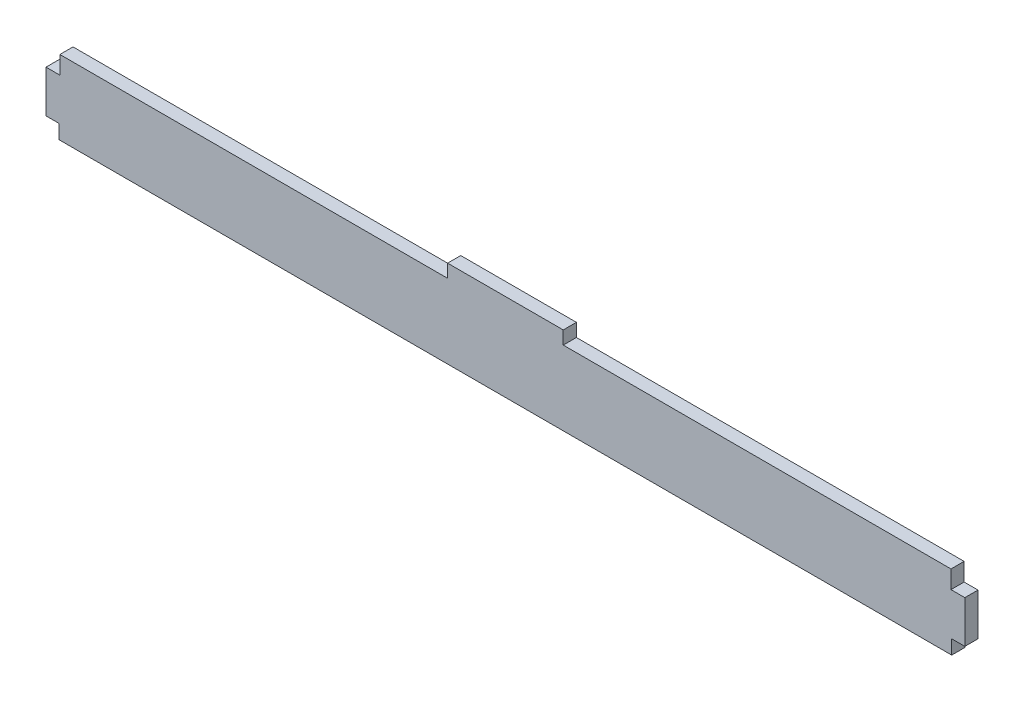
from build123d import *

# Parameters (mm, degrees)
BOSS_EXTRUDE1_DEPTH = 1.524


with BuildPart() as part:
    # Sketch1 → Boss-Extrude1 (new body)
    with BuildSketch(Plane.XY):
        Polygon((111.159880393, -1.524), (111.159880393, 0), (124.565719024, 0), (124.565719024, -1.524), (169.511666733, -1.524), (169.511666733, -3.599548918), (171.121449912, -3.599548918), (171.121449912, -8.495278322), (169.597449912, -8.495278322), (169.597449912, -10.133194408), (66.128149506, -10.133194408), (66.128149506, -8.495278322), (64.604149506, -8.495278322), (64.604149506, -3.599548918), (66.213932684, -3.599548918), (66.213932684, -1.524), align=None)
    extrude(amount=BOSS_EXTRUDE1_DEPTH)


solid = part.part
